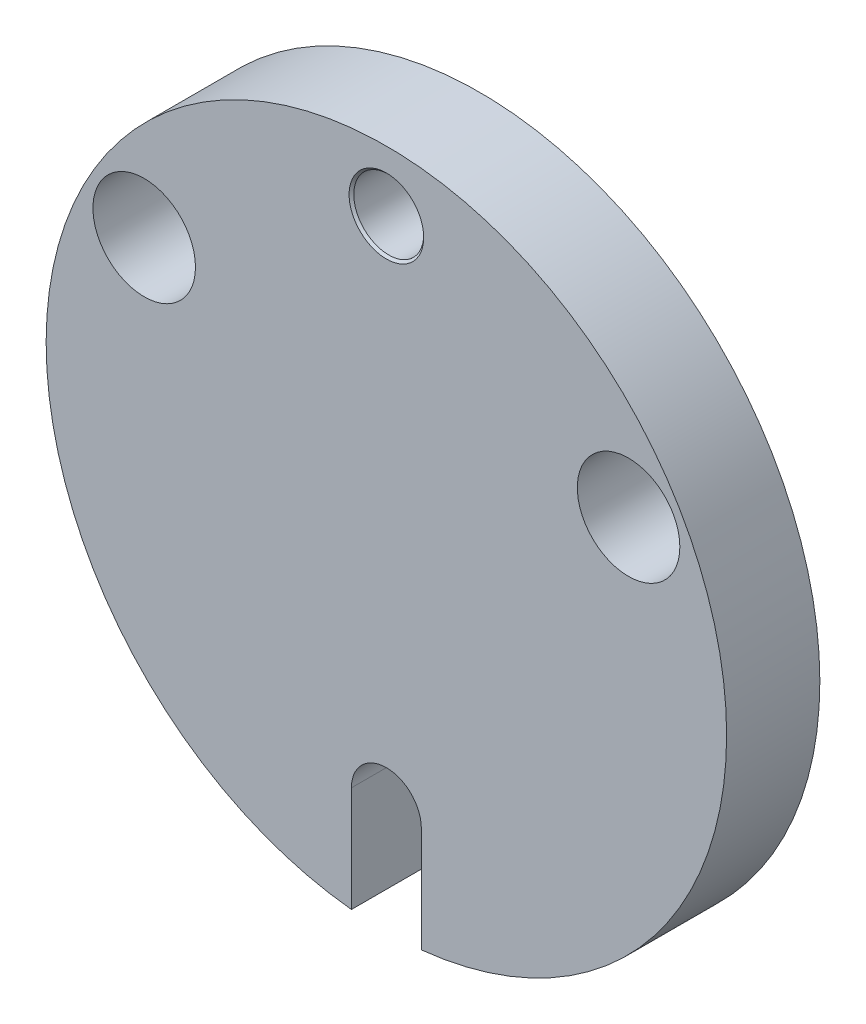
ISO-10303-21;
HEADER;
FILE_DESCRIPTION(('STEP AP214'),'2;1');
FILE_NAME('part.step','',(''),(''),'','','');
FILE_SCHEMA(('AUTOMOTIVE_DESIGN { 1 0 10303 214 1 1 1 1 }'));
ENDSEC;
DATA;
#1=APPLICATION_CONTEXT('core data for automotive mechanical design processes');
#2=APPLICATION_PROTOCOL_DEFINITION('international standard','automotive_design',2000,#1);
#3=PRODUCT_CONTEXT('',#1,'mechanical');
#4=PRODUCT('Part','Part','',(#3));
#5=PRODUCT_RELATED_PRODUCT_CATEGORY('part','',(#4));
#6=PRODUCT_DEFINITION_FORMATION('','',#4);
#7=PRODUCT_DEFINITION_CONTEXT('part definition',#1,'design');
#8=PRODUCT_DEFINITION('design','',#6,#7);
#9=PRODUCT_DEFINITION_SHAPE('','',#8);
#10=(LENGTH_UNIT() NAMED_UNIT(*) SI_UNIT(.MILLI.,.METRE.));
#11=(NAMED_UNIT(*) PLANE_ANGLE_UNIT() SI_UNIT($,.RADIAN.));
#12=(NAMED_UNIT(*) SI_UNIT($,.STERADIAN.) SOLID_ANGLE_UNIT());
#13=UNCERTAINTY_MEASURE_WITH_UNIT(LENGTH_MEASURE(1.E-05),#10,'distance_accuracy_value','');
#14=(GEOMETRIC_REPRESENTATION_CONTEXT(3) GLOBAL_UNCERTAINTY_ASSIGNED_CONTEXT((#13)) GLOBAL_UNIT_ASSIGNED_CONTEXT((#10,
#11,#12)) REPRESENTATION_CONTEXT('',''));
#15=CARTESIAN_POINT('',(0.,0.,0.));
#16=DIRECTION('',(0.,0.,1.));
#17=DIRECTION('',(1.,0.,0.));
#18=AXIS2_PLACEMENT_3D('',#15,#16,#17);
#19=CARTESIAN_POINT('',(0.,0.,0.));
#20=DIRECTION('',(0.,0.,1.));
#21=DIRECTION('',(1.,0.,0.));
#22=AXIS2_PLACEMENT_3D('',#19,#20,#21);
#23=PLANE('',#22);
#24=CARTESIAN_POINT('',(0.,6.,0.));
#25=DIRECTION('',(0.,0.,1.));
#26=DIRECTION('',(1.,0.,0.));
#27=AXIS2_PLACEMENT_3D('',#24,#25,#26);
#28=CIRCLE('',#27,0.8);
#29=CARTESIAN_POINT('',(0.8,6.,0.));
#30=VERTEX_POINT('',#29);
#31=EDGE_CURVE('E135',#30,#30,#28,.T.);
#32=ORIENTED_EDGE('',*,*,#31,.T.);
#33=EDGE_LOOP('',(#32));
#34=FACE_BOUND('',#33,.T.);
#35=CARTESIAN_POINT('',(0.,0.,0.));
#36=DIRECTION('',(0.,0.,1.));
#37=DIRECTION('',(1.,0.,0.));
#38=AXIS2_PLACEMENT_3D('',#35,#36,#37);
#39=CIRCLE('',#38,7.3);
#40=CARTESIAN_POINT('',(0.749999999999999,-7.26137039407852,0.));
#41=VERTEX_POINT('',#40);
#42=CARTESIAN_POINT('',(-0.749999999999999,-7.26137039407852,0.));
#43=VERTEX_POINT('',#42);
#44=EDGE_CURVE('E125',#41,#43,#39,.T.);
#45=ORIENTED_EDGE('',*,*,#44,.F.);
#46=DIRECTION('',(0.,1.,0.));
#47=VECTOR('',#46,1.);
#48=CARTESIAN_POINT('',(0.75,0.,0.));
#49=LINE('',#48,#47);
#50=CARTESIAN_POINT('',(0.749999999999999,-5.,0.));
#51=VERTEX_POINT('',#50);
#52=EDGE_CURVE('E58',#41,#51,#49,.T.);
#53=ORIENTED_EDGE('',*,*,#52,.T.);
#54=CARTESIAN_POINT('',(0.,-5.,0.));
#55=DIRECTION('',(0.,0.,1.));
#56=DIRECTION('',(1.,0.,0.));
#57=AXIS2_PLACEMENT_3D('',#54,#55,#56);
#58=CIRCLE('',#57,0.749999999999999);
#59=CARTESIAN_POINT('',(-0.749999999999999,-5.,0.));
#60=VERTEX_POINT('',#59);
#61=EDGE_CURVE('E100',#51,#60,#58,.T.);
#62=ORIENTED_EDGE('',*,*,#61,.T.);
#63=DIRECTION('',(0.,-1.,0.));
#64=VECTOR('',#63,1.);
#65=CARTESIAN_POINT('',(-0.749999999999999,-5.,0.));
#66=LINE('',#65,#64);
#67=EDGE_CURVE('E103',#60,#43,#66,.T.);
#68=ORIENTED_EDGE('',*,*,#67,.T.);
#69=EDGE_LOOP('',(#45,#53,#62,#68));
#70=FACE_BOUND('',#69,.T.);
#71=CARTESIAN_POINT('',(-5.19615242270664,2.99999999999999,0.));
#72=DIRECTION('',(0.,0.,1.));
#73=DIRECTION('',(1.,0.,0.));
#74=AXIS2_PLACEMENT_3D('',#71,#72,#73);
#75=CIRCLE('',#74,1.1);
#76=CARTESIAN_POINT('',(-4.09615242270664,2.99999999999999,0.));
#77=VERTEX_POINT('',#76);
#78=EDGE_CURVE('E122',#77,#77,#75,.T.);
#79=ORIENTED_EDGE('',*,*,#78,.T.);
#80=EDGE_LOOP('',(#79));
#81=FACE_BOUND('',#80,.T.);
#82=CARTESIAN_POINT('',(5.19615242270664,2.99999999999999,0.));
#83=DIRECTION('',(0.,0.,1.));
#84=DIRECTION('',(1.,0.,0.));
#85=AXIS2_PLACEMENT_3D('',#82,#83,#84);
#86=CIRCLE('',#85,1.1);
#87=CARTESIAN_POINT('',(6.29615242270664,2.99999999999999,0.));
#88=VERTEX_POINT('',#87);
#89=EDGE_CURVE('E116',#88,#88,#86,.T.);
#90=ORIENTED_EDGE('',*,*,#89,.T.);
#91=EDGE_LOOP('',(#90));
#92=FACE_BOUND('',#91,.T.);
#93=CARTESIAN_POINT('',(0.,0.,0.));
#94=DIRECTION('',(0.,0.,1.));
#95=DIRECTION('',(1.,0.,0.));
#96=AXIS2_PLACEMENT_3D('',#93,#94,#95);
#97=CIRCLE('',#96,2.5);
#98=CARTESIAN_POINT('',(2.5,0.,0.));
#99=VERTEX_POINT('',#98);
#100=EDGE_CURVE('E132',#99,#99,#97,.F.);
#101=ORIENTED_EDGE('',*,*,#100,.F.);
#102=EDGE_LOOP('',(#101));
#103=FACE_BOUND('',#102,.T.);
#104=ADVANCED_FACE('F34',(#34,#70,#81,#92,#103),#23,.F.);
#105=CARTESIAN_POINT('',(0.,0.,2.));
#106=DIRECTION('',(0.,0.,-1.));
#107=DIRECTION('',(-1.,0.,0.));
#108=AXIS2_PLACEMENT_3D('',#105,#106,#107);
#109=CYLINDRICAL_SURFACE('',#108,7.3);
#110=CARTESIAN_POINT('',(0.,0.,2.));
#111=DIRECTION('',(0.,0.,1.));
#112=DIRECTION('',(1.,0.,0.));
#113=AXIS2_PLACEMENT_3D('',#110,#111,#112);
#114=CIRCLE('',#113,7.3);
#115=CARTESIAN_POINT('',(0.749999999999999,-7.26137039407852,2.));
#116=VERTEX_POINT('',#115);
#117=CARTESIAN_POINT('',(-0.749999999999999,-7.26137039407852,2.));
#118=VERTEX_POINT('',#117);
#119=EDGE_CURVE('E128',#116,#118,#114,.T.);
#120=ORIENTED_EDGE('',*,*,#119,.F.);
#121=DIRECTION('',(0.,0.,-1.));
#122=VECTOR('',#121,1.);
#123=CARTESIAN_POINT('',(0.749999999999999,-7.26137039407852,2.));
#124=LINE('',#123,#122);
#125=EDGE_CURVE('E111',#116,#41,#124,.T.);
#126=ORIENTED_EDGE('',*,*,#125,.T.);
#127=ORIENTED_EDGE('',*,*,#44,.T.);
#128=DIRECTION('',(0.,0.,-1.));
#129=VECTOR('',#128,1.);
#130=CARTESIAN_POINT('',(-0.749999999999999,-7.26137039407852,2.));
#131=LINE('',#130,#129);
#132=EDGE_CURVE('E50',#43,#118,#131,.F.);
#133=ORIENTED_EDGE('',*,*,#132,.T.);
#134=EDGE_LOOP('',(#120,#126,#127,#133));
#135=FACE_BOUND('',#134,.T.);
#136=ADVANCED_FACE('F36',(#135),#109,.T.);
#137=CARTESIAN_POINT('',(0.,0.,2.));
#138=DIRECTION('',(0.,0.,1.));
#139=DIRECTION('',(1.,0.,0.));
#140=AXIS2_PLACEMENT_3D('',#137,#138,#139);
#141=PLANE('',#140);
#142=CARTESIAN_POINT('',(0.,6.,2.));
#143=DIRECTION('',(0.,0.,1.));
#144=DIRECTION('',(1.,0.,0.));
#145=AXIS2_PLACEMENT_3D('',#142,#143,#144);
#146=CIRCLE('',#145,0.8);
#147=CARTESIAN_POINT('',(0.8,6.,2.));
#148=VERTEX_POINT('',#147);
#149=EDGE_CURVE('E11',#148,#148,#146,.F.);
#150=ORIENTED_EDGE('',*,*,#149,.T.);
#151=EDGE_LOOP('',(#150));
#152=FACE_BOUND('',#151,.T.);
#153=DIRECTION('',(0.,1.,0.));
#154=VECTOR('',#153,1.);
#155=CARTESIAN_POINT('',(0.749999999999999,-5.,2.));
#156=LINE('',#155,#154);
#157=CARTESIAN_POINT('',(0.749999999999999,-5.,2.));
#158=VERTEX_POINT('',#157);
#159=EDGE_CURVE('E98',#116,#158,#156,.T.);
#160=ORIENTED_EDGE('',*,*,#159,.F.);
#161=ORIENTED_EDGE('',*,*,#119,.T.);
#162=DIRECTION('',(0.,-1.,0.));
#163=VECTOR('',#162,1.);
#164=CARTESIAN_POINT('',(-0.749999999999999,-5.,2.));
#165=LINE('',#164,#163);
#166=CARTESIAN_POINT('',(-0.749999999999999,-5.,2.));
#167=VERTEX_POINT('',#166);
#168=EDGE_CURVE('E96',#167,#118,#165,.T.);
#169=ORIENTED_EDGE('',*,*,#168,.F.);
#170=CARTESIAN_POINT('',(0.,-5.,2.));
#171=DIRECTION('',(0.,0.,1.));
#172=DIRECTION('',(1.,0.,0.));
#173=AXIS2_PLACEMENT_3D('',#170,#171,#172);
#174=CIRCLE('',#173,0.749999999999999);
#175=EDGE_CURVE('E91',#158,#167,#174,.T.);
#176=ORIENTED_EDGE('',*,*,#175,.F.);
#177=EDGE_LOOP('',(#160,#161,#169,#176));
#178=FACE_BOUND('',#177,.T.);
#179=CARTESIAN_POINT('',(5.19615242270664,2.99999999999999,2.));
#180=DIRECTION('',(0.,0.,1.));
#181=DIRECTION('',(1.,0.,0.));
#182=AXIS2_PLACEMENT_3D('',#179,#180,#181);
#183=CIRCLE('',#182,1.1);
#184=CARTESIAN_POINT('',(6.29615242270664,2.99999999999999,2.));
#185=VERTEX_POINT('',#184);
#186=EDGE_CURVE('E113',#185,#185,#183,.T.);
#187=ORIENTED_EDGE('',*,*,#186,.F.);
#188=EDGE_LOOP('',(#187));
#189=FACE_BOUND('',#188,.T.);
#190=CARTESIAN_POINT('',(-5.19615242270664,2.99999999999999,2.));
#191=DIRECTION('',(0.,0.,1.));
#192=DIRECTION('',(1.,0.,0.));
#193=AXIS2_PLACEMENT_3D('',#190,#191,#192);
#194=CIRCLE('',#193,1.1);
#195=CARTESIAN_POINT('',(-4.09615242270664,2.99999999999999,2.));
#196=VERTEX_POINT('',#195);
#197=EDGE_CURVE('E119',#196,#196,#194,.T.);
#198=ORIENTED_EDGE('',*,*,#197,.F.);
#199=EDGE_LOOP('',(#198));
#200=FACE_BOUND('',#199,.T.);
#201=ADVANCED_FACE('F196',(#152,#178,#189,#200),#141,.T.);
#202=CARTESIAN_POINT('',(0.,6.,0.));
#203=DIRECTION('',(0.,0.,1.));
#204=DIRECTION('',(1.,0.,0.));
#205=AXIS2_PLACEMENT_3D('',#202,#203,#204);
#206=CYLINDRICAL_SURFACE('',#205,0.75);
#207=CARTESIAN_POINT('',(0.,6.,0.0500000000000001));
#208=DIRECTION('',(0.,0.,1.));
#209=DIRECTION('',(1.,0.,0.));
#210=AXIS2_PLACEMENT_3D('',#207,#208,#209);
#211=CIRCLE('',#210,0.75);
#212=CARTESIAN_POINT('',(0.75,6.,0.0500000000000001));
#213=VERTEX_POINT('',#212);
#214=EDGE_CURVE('E43',#213,#213,#211,.F.);
#215=ORIENTED_EDGE('',*,*,#214,.T.);
#216=EDGE_LOOP('',(#215));
#217=FACE_BOUND('',#216,.T.);
#218=CARTESIAN_POINT('',(0.,6.,1.95));
#219=DIRECTION('',(0.,0.,1.));
#220=DIRECTION('',(1.,0.,0.));
#221=AXIS2_PLACEMENT_3D('',#218,#219,#220);
#222=CIRCLE('',#221,0.75);
#223=CARTESIAN_POINT('',(0.75,6.,1.95));
#224=VERTEX_POINT('',#223);
#225=EDGE_CURVE('E139',#224,#224,#222,.T.);
#226=ORIENTED_EDGE('',*,*,#225,.T.);
#227=EDGE_LOOP('',(#226));
#228=FACE_BOUND('',#227,.T.);
#229=ADVANCED_FACE('F147',(#217,#228),#206,.F.);
#230=CARTESIAN_POINT('',(-5.19615242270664,2.99999999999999,0.));
#231=DIRECTION('',(0.,0.,1.));
#232=DIRECTION('',(1.,0.,0.));
#233=AXIS2_PLACEMENT_3D('',#230,#231,#232);
#234=CYLINDRICAL_SURFACE('',#233,1.1);
#235=ORIENTED_EDGE('',*,*,#78,.F.);
#236=EDGE_LOOP('',(#235));
#237=FACE_BOUND('',#236,.T.);
#238=ORIENTED_EDGE('',*,*,#197,.T.);
#239=EDGE_LOOP('',(#238));
#240=FACE_BOUND('',#239,.T.);
#241=ADVANCED_FACE('F190',(#237,#240),#234,.F.);
#242=CARTESIAN_POINT('',(5.19615242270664,2.99999999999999,0.));
#243=DIRECTION('',(0.,0.,1.));
#244=DIRECTION('',(1.,0.,0.));
#245=AXIS2_PLACEMENT_3D('',#242,#243,#244);
#246=CYLINDRICAL_SURFACE('',#245,1.1);
#247=ORIENTED_EDGE('',*,*,#89,.F.);
#248=EDGE_LOOP('',(#247));
#249=FACE_BOUND('',#248,.T.);
#250=ORIENTED_EDGE('',*,*,#186,.T.);
#251=EDGE_LOOP('',(#250));
#252=FACE_BOUND('',#251,.T.);
#253=ADVANCED_FACE('F185',(#249,#252),#246,.F.);
#254=CARTESIAN_POINT('',(0.749999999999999,-5.,0.));
#255=DIRECTION('',(1.,0.,0.));
#256=DIRECTION('',(0.,1.,0.));
#257=AXIS2_PLACEMENT_3D('',#254,#255,#256);
#258=PLANE('',#257);
#259=ORIENTED_EDGE('',*,*,#159,.T.);
#260=DIRECTION('',(0.,0.,1.));
#261=VECTOR('',#260,1.);
#262=CARTESIAN_POINT('',(0.749999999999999,-5.,0.));
#263=LINE('',#262,#261);
#264=EDGE_CURVE('E106',#51,#158,#263,.T.);
#265=ORIENTED_EDGE('',*,*,#264,.F.);
#266=ORIENTED_EDGE('',*,*,#52,.F.);
#267=ORIENTED_EDGE('',*,*,#125,.F.);
#268=EDGE_LOOP('',(#259,#265,#266,#267));
#269=FACE_BOUND('',#268,.T.);
#270=ADVANCED_FACE('F182',(#269),#258,.F.);
#271=CARTESIAN_POINT('',(-0.749999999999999,-5.,0.));
#272=DIRECTION('',(-1.,0.,0.));
#273=DIRECTION('',(0.,-1.,0.));
#274=AXIS2_PLACEMENT_3D('',#271,#272,#273);
#275=PLANE('',#274);
#276=ORIENTED_EDGE('',*,*,#67,.F.);
#277=DIRECTION('',(0.,0.,1.));
#278=VECTOR('',#277,1.);
#279=CARTESIAN_POINT('',(-0.749999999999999,-5.,0.));
#280=LINE('',#279,#278);
#281=EDGE_CURVE('E105',#60,#167,#280,.T.);
#282=ORIENTED_EDGE('',*,*,#281,.T.);
#283=ORIENTED_EDGE('',*,*,#168,.T.);
#284=ORIENTED_EDGE('',*,*,#132,.F.);
#285=EDGE_LOOP('',(#276,#282,#283,#284));
#286=FACE_BOUND('',#285,.T.);
#287=ADVANCED_FACE('F177',(#286),#275,.F.);
#288=CARTESIAN_POINT('',(0.,-5.,0.));
#289=DIRECTION('',(0.,0.,1.));
#290=DIRECTION('',(1.,0.,0.));
#291=AXIS2_PLACEMENT_3D('',#288,#289,#290);
#292=CYLINDRICAL_SURFACE('',#291,0.749999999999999);
#293=ORIENTED_EDGE('',*,*,#175,.T.);
#294=ORIENTED_EDGE('',*,*,#281,.F.);
#295=ORIENTED_EDGE('',*,*,#61,.F.);
#296=ORIENTED_EDGE('',*,*,#264,.T.);
#297=EDGE_LOOP('',(#293,#294,#295,#296));
#298=FACE_BOUND('',#297,.T.);
#299=ADVANCED_FACE('F169',(#298),#292,.F.);
#300=CARTESIAN_POINT('',(0.,0.,0.));
#301=DIRECTION('',(0.,0.,1.));
#302=DIRECTION('',(-1.,0.,0.));
#303=AXIS2_PLACEMENT_3D('',#300,#301,#302);
#304=CONICAL_SURFACE('',#303,2.5,0.349065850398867);
#305=CARTESIAN_POINT('',(0.,0.,-0.5));
#306=DIRECTION('',(0.,0.,-1.));
#307=DIRECTION('',(-1.,0.,0.));
#308=AXIS2_PLACEMENT_3D('',#305,#306,#307);
#309=CIRCLE('',#308,2.3180148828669);
#310=CARTESIAN_POINT('',(-2.3180148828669,0.,-0.5));
#311=VERTEX_POINT('',#310);
#312=EDGE_CURVE('E88',#311,#311,#309,.T.);
#313=ORIENTED_EDGE('',*,*,#312,.F.);
#314=EDGE_LOOP('',(#313));
#315=FACE_BOUND('',#314,.T.);
#316=ORIENTED_EDGE('',*,*,#100,.T.);
#317=EDGE_LOOP('',(#316));
#318=FACE_BOUND('',#317,.T.);
#319=ADVANCED_FACE('F167',(#315,#318),#304,.T.);
#320=CARTESIAN_POINT('',(0.,0.,-0.5));
#321=DIRECTION('',(0.,0.,-1.));
#322=DIRECTION('',(-1.,0.,0.));
#323=AXIS2_PLACEMENT_3D('',#320,#321,#322);
#324=PLANE('',#323);
#325=CARTESIAN_POINT('',(0.,0.,-0.5));
#326=DIRECTION('',(0.,0.,-1.));
#327=DIRECTION('',(-1.,0.,0.));
#328=AXIS2_PLACEMENT_3D('',#325,#326,#327);
#329=CIRCLE('',#328,1.5);
#330=CARTESIAN_POINT('',(-1.5,0.,-0.5));
#331=VERTEX_POINT('',#330);
#332=EDGE_CURVE('E86',#331,#331,#329,.T.);
#333=ORIENTED_EDGE('',*,*,#332,.F.);
#334=EDGE_LOOP('',(#333));
#335=FACE_BOUND('',#334,.T.);
#336=ORIENTED_EDGE('',*,*,#312,.T.);
#337=EDGE_LOOP('',(#336));
#338=FACE_BOUND('',#337,.T.);
#339=ADVANCED_FACE('F82',(#335,#338),#324,.T.);
#340=CARTESIAN_POINT('',(0.,0.,-0.5));
#341=DIRECTION('',(0.,0.,-1.));
#342=DIRECTION('',(-1.,0.,0.));
#343=AXIS2_PLACEMENT_3D('',#340,#341,#342);
#344=CONICAL_SURFACE('',#343,1.5,0.78539816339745);
#345=CARTESIAN_POINT('',(0.,0.,0.999999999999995));
#346=VERTEX_POINT('',#345);
#347=VERTEX_LOOP('',#346);
#348=FACE_BOUND('',#347,.T.);
#349=ORIENTED_EDGE('',*,*,#332,.T.);
#350=EDGE_LOOP('',(#349));
#351=FACE_BOUND('',#350,.T.);
#352=ADVANCED_FACE('F78',(#348,#351),#344,.F.);
#353=CARTESIAN_POINT('',(0.,6.,0.));
#354=DIRECTION('',(0.,0.,-1.));
#355=DIRECTION('',(-1.,0.,0.));
#356=AXIS2_PLACEMENT_3D('',#353,#354,#355);
#357=CONICAL_SURFACE('',#356,0.8,0.785398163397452);
#358=ORIENTED_EDGE('',*,*,#214,.F.);
#359=EDGE_LOOP('',(#358));
#360=FACE_BOUND('',#359,.T.);
#361=ORIENTED_EDGE('',*,*,#31,.F.);
#362=EDGE_LOOP('',(#361));
#363=FACE_BOUND('',#362,.T.);
#364=ADVANCED_FACE('F81',(#360,#363),#357,.F.);
#365=CARTESIAN_POINT('',(0.,6.,1.95));
#366=DIRECTION('',(0.,0.,1.));
#367=DIRECTION('',(1.,0.,0.));
#368=AXIS2_PLACEMENT_3D('',#365,#366,#367);
#369=CONICAL_SURFACE('',#368,0.75,0.785398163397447);
#370=ORIENTED_EDGE('',*,*,#149,.F.);
#371=EDGE_LOOP('',(#370));
#372=FACE_BOUND('',#371,.T.);
#373=ORIENTED_EDGE('',*,*,#225,.F.);
#374=EDGE_LOOP('',(#373));
#375=FACE_BOUND('',#374,.T.);
#376=ADVANCED_FACE('F152',(#372,#375),#369,.F.);
#377=CLOSED_SHELL('',(#104,#136,#201,#229,#241,#253,#270,#287,#299,#319,#339,#352,#364,#376));
#378=MANIFOLD_SOLID_BREP('B2',#377);
#379=ADVANCED_BREP_SHAPE_REPRESENTATION('',(#18,#378),#14);
#380=SHAPE_DEFINITION_REPRESENTATION(#9,#379);
ENDSEC;
END-ISO-10303-21;
